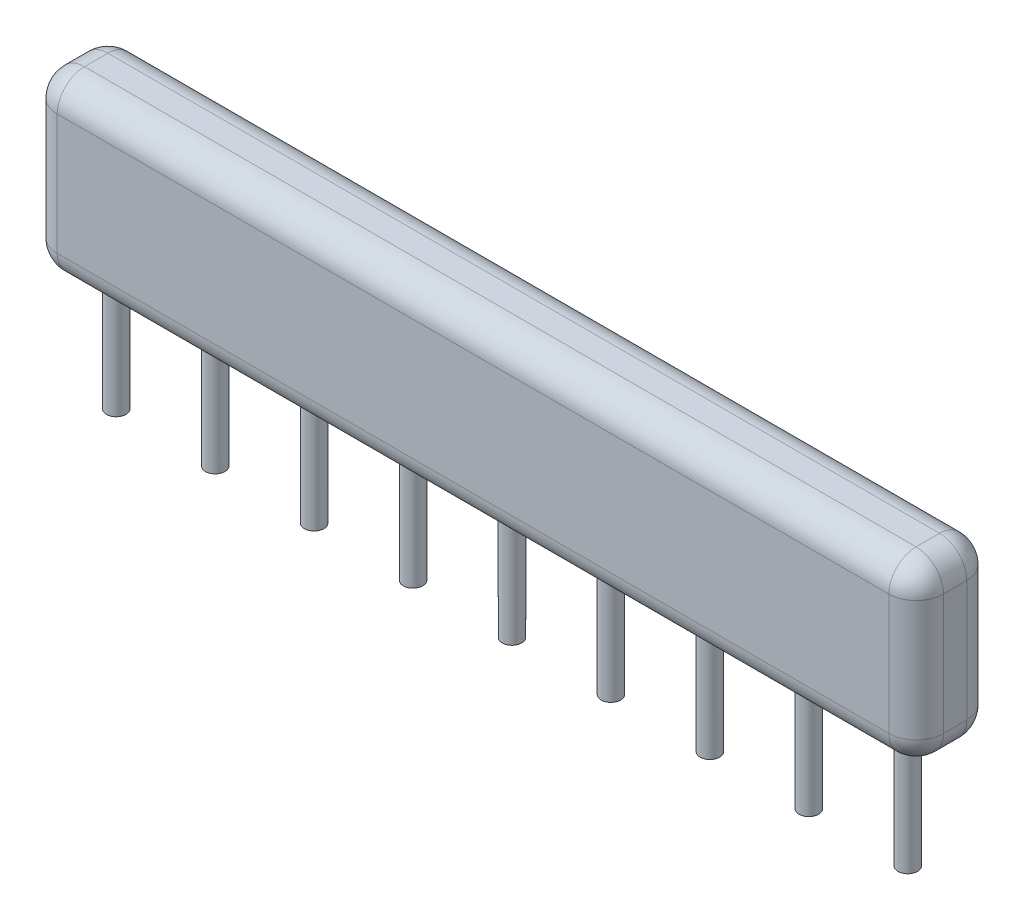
ISO-10303-21;
HEADER;
FILE_DESCRIPTION(('STEP AP214'),'2;1');
FILE_NAME('part.step','',(''),(''),'','','');
FILE_SCHEMA(('AUTOMOTIVE_DESIGN { 1 0 10303 214 1 1 1 1 }'));
ENDSEC;
DATA;
#1=APPLICATION_CONTEXT('core data for automotive mechanical design processes');
#2=APPLICATION_PROTOCOL_DEFINITION('international standard','automotive_design',2000,#1);
#3=PRODUCT_CONTEXT('',#1,'mechanical');
#4=PRODUCT('Part','Part','',(#3));
#5=PRODUCT_RELATED_PRODUCT_CATEGORY('part','',(#4));
#6=PRODUCT_DEFINITION_FORMATION('','',#4);
#7=PRODUCT_DEFINITION_CONTEXT('part definition',#1,'design');
#8=PRODUCT_DEFINITION('design','',#6,#7);
#9=PRODUCT_DEFINITION_SHAPE('','',#8);
#10=(LENGTH_UNIT() NAMED_UNIT(*) SI_UNIT(.MILLI.,.METRE.));
#11=(NAMED_UNIT(*) PLANE_ANGLE_UNIT() SI_UNIT($,.RADIAN.));
#12=(NAMED_UNIT(*) SI_UNIT($,.STERADIAN.) SOLID_ANGLE_UNIT());
#13=UNCERTAINTY_MEASURE_WITH_UNIT(LENGTH_MEASURE(1.E-05),#10,'distance_accuracy_value','');
#14=(GEOMETRIC_REPRESENTATION_CONTEXT(3) GLOBAL_UNCERTAINTY_ASSIGNED_CONTEXT((#13)) GLOBAL_UNIT_ASSIGNED_CONTEXT((#10,
#11,#12)) REPRESENTATION_CONTEXT('',''));
#15=CARTESIAN_POINT('',(0.,0.,0.));
#16=DIRECTION('',(0.,0.,1.));
#17=DIRECTION('',(1.,0.,0.));
#18=AXIS2_PLACEMENT_3D('',#15,#16,#17);
#19=CARTESIAN_POINT('',(0.,0.,2.));
#20=DIRECTION('',(0.,1.,0.));
#21=DIRECTION('',(0.,0.,1.));
#22=AXIS2_PLACEMENT_3D('',#19,#20,#21);
#23=PLANE('',#22);
#24=DIRECTION('',(0.,0.,-1.));
#25=VECTOR('',#24,1.);
#26=CARTESIAN_POINT('',(0.7,0.,2.));
#27=LINE('',#26,#25);
#28=CARTESIAN_POINT('',(0.7,0.,1.3));
#29=VERTEX_POINT('',#28);
#30=CARTESIAN_POINT('',(0.7,0.,0.7));
#31=VERTEX_POINT('',#30);
#32=EDGE_CURVE('E153',#29,#31,#27,.T.);
#33=ORIENTED_EDGE('',*,*,#32,.T.);
#34=DIRECTION('',(1.,0.,0.));
#35=VECTOR('',#34,1.);
#36=CARTESIAN_POINT('',(0.,0.,0.7));
#37=LINE('',#36,#35);
#38=CARTESIAN_POINT('',(22.05,0.,0.7));
#39=VERTEX_POINT('',#38);
#40=EDGE_CURVE('E266',#31,#39,#37,.T.);
#41=ORIENTED_EDGE('',*,*,#40,.T.);
#42=DIRECTION('',(0.,0.,-1.));
#43=VECTOR('',#42,1.);
#44=CARTESIAN_POINT('',(22.05,0.,2.));
#45=LINE('',#44,#43);
#46=CARTESIAN_POINT('',(22.05,0.,1.3));
#47=VERTEX_POINT('',#46);
#48=EDGE_CURVE('E263',#39,#47,#45,.F.);
#49=ORIENTED_EDGE('',*,*,#48,.T.);
#50=DIRECTION('',(1.,0.,0.));
#51=VECTOR('',#50,1.);
#52=CARTESIAN_POINT('',(0.,0.,1.3));
#53=LINE('',#52,#51);
#54=EDGE_CURVE('E261',#47,#29,#53,.F.);
#55=ORIENTED_EDGE('',*,*,#54,.T.);
#56=EDGE_LOOP('',(#33,#41,#49,#55));
#57=FACE_BOUND('',#56,.T.);
#58=CARTESIAN_POINT('',(18.995,0.,1.));
#59=DIRECTION('',(0.,1.,0.));
#60=DIRECTION('',(0.,0.,1.));
#61=AXIS2_PLACEMENT_3D('',#58,#59,#60);
#62=CIRCLE('',#61,0.25);
#63=CARTESIAN_POINT('',(18.995,0.,1.25));
#64=VERTEX_POINT('',#63);
#65=EDGE_CURVE('E245',#64,#64,#62,.F.);
#66=ORIENTED_EDGE('',*,*,#65,.F.);
#67=EDGE_LOOP('',(#66));
#68=FACE_BOUND('',#67,.T.);
#69=CARTESIAN_POINT('',(13.915,0.,1.));
#70=DIRECTION('',(0.,1.,0.));
#71=DIRECTION('',(0.,0.,1.));
#72=AXIS2_PLACEMENT_3D('',#69,#70,#71);
#73=CIRCLE('',#72,0.25);
#74=CARTESIAN_POINT('',(13.915,0.,1.25));
#75=VERTEX_POINT('',#74);
#76=EDGE_CURVE('E239',#75,#75,#73,.F.);
#77=ORIENTED_EDGE('',*,*,#76,.F.);
#78=EDGE_LOOP('',(#77));
#79=FACE_BOUND('',#78,.T.);
#80=CARTESIAN_POINT('',(8.835,0.,1.));
#81=DIRECTION('',(0.,1.,0.));
#82=DIRECTION('',(0.,0.,1.));
#83=AXIS2_PLACEMENT_3D('',#80,#81,#82);
#84=CIRCLE('',#83,0.25);
#85=CARTESIAN_POINT('',(8.835,0.,1.25));
#86=VERTEX_POINT('',#85);
#87=EDGE_CURVE('E233',#86,#86,#84,.F.);
#88=ORIENTED_EDGE('',*,*,#87,.F.);
#89=EDGE_LOOP('',(#88));
#90=FACE_BOUND('',#89,.T.);
#91=CARTESIAN_POINT('',(3.755,0.,1.));
#92=DIRECTION('',(0.,1.,0.));
#93=DIRECTION('',(0.,0.,1.));
#94=AXIS2_PLACEMENT_3D('',#91,#92,#93);
#95=CIRCLE('',#94,0.25);
#96=CARTESIAN_POINT('',(3.755,0.,1.25));
#97=VERTEX_POINT('',#96);
#98=EDGE_CURVE('E227',#97,#97,#95,.F.);
#99=ORIENTED_EDGE('',*,*,#98,.F.);
#100=EDGE_LOOP('',(#99));
#101=FACE_BOUND('',#100,.T.);
#102=CARTESIAN_POINT('',(1.215,0.,1.));
#103=DIRECTION('',(0.,1.,0.));
#104=DIRECTION('',(0.,0.,1.));
#105=AXIS2_PLACEMENT_3D('',#102,#103,#104);
#106=CIRCLE('',#105,0.25);
#107=CARTESIAN_POINT('',(1.215,0.,1.25));
#108=VERTEX_POINT('',#107);
#109=EDGE_CURVE('E224',#108,#108,#106,.F.);
#110=ORIENTED_EDGE('',*,*,#109,.F.);
#111=EDGE_LOOP('',(#110));
#112=FACE_BOUND('',#111,.T.);
#113=CARTESIAN_POINT('',(6.295,0.,1.));
#114=DIRECTION('',(0.,1.,0.));
#115=DIRECTION('',(0.,0.,1.));
#116=AXIS2_PLACEMENT_3D('',#113,#114,#115);
#117=CIRCLE('',#116,0.25);
#118=CARTESIAN_POINT('',(6.295,0.,1.25));
#119=VERTEX_POINT('',#118);
#120=EDGE_CURVE('E230',#119,#119,#117,.F.);
#121=ORIENTED_EDGE('',*,*,#120,.F.);
#122=EDGE_LOOP('',(#121));
#123=FACE_BOUND('',#122,.T.);
#124=CARTESIAN_POINT('',(11.375,0.,1.));
#125=DIRECTION('',(0.,1.,0.));
#126=DIRECTION('',(0.,0.,1.));
#127=AXIS2_PLACEMENT_3D('',#124,#125,#126);
#128=CIRCLE('',#127,0.25);
#129=CARTESIAN_POINT('',(11.375,0.,1.25));
#130=VERTEX_POINT('',#129);
#131=EDGE_CURVE('E236',#130,#130,#128,.F.);
#132=ORIENTED_EDGE('',*,*,#131,.F.);
#133=EDGE_LOOP('',(#132));
#134=FACE_BOUND('',#133,.T.);
#135=CARTESIAN_POINT('',(16.455,0.,1.));
#136=DIRECTION('',(0.,1.,0.));
#137=DIRECTION('',(0.,0.,1.));
#138=AXIS2_PLACEMENT_3D('',#135,#136,#137);
#139=CIRCLE('',#138,0.25);
#140=CARTESIAN_POINT('',(16.455,0.,1.25));
#141=VERTEX_POINT('',#140);
#142=EDGE_CURVE('E242',#141,#141,#139,.F.);
#143=ORIENTED_EDGE('',*,*,#142,.F.);
#144=EDGE_LOOP('',(#143));
#145=FACE_BOUND('',#144,.T.);
#146=CARTESIAN_POINT('',(21.535,0.,1.));
#147=DIRECTION('',(0.,1.,0.));
#148=DIRECTION('',(0.,0.,1.));
#149=AXIS2_PLACEMENT_3D('',#146,#147,#148);
#150=CIRCLE('',#149,0.25);
#151=CARTESIAN_POINT('',(21.535,0.,1.25));
#152=VERTEX_POINT('',#151);
#153=EDGE_CURVE('E141',#152,#152,#150,.F.);
#154=ORIENTED_EDGE('',*,*,#153,.F.);
#155=EDGE_LOOP('',(#154));
#156=FACE_BOUND('',#155,.T.);
#157=ADVANCED_FACE('F30',(#57,#68,#79,#90,#101,#112,#123,#134,#145,#156),#23,.F.);
#158=CARTESIAN_POINT('',(0.,4.5,2.));
#159=DIRECTION('',(1.,0.,0.));
#160=DIRECTION('',(0.,0.,-1.));
#161=AXIS2_PLACEMENT_3D('',#158,#159,#160);
#162=PLANE('',#161);
#163=DIRECTION('',(0.,0.,-1.));
#164=VECTOR('',#163,1.);
#165=CARTESIAN_POINT('',(0.,3.8,2.));
#166=LINE('',#165,#164);
#167=CARTESIAN_POINT('',(0.,3.8,1.3));
#168=VERTEX_POINT('',#167);
#169=CARTESIAN_POINT('',(0.,3.8,0.7));
#170=VERTEX_POINT('',#169);
#171=EDGE_CURVE('E129',#168,#170,#166,.T.);
#172=ORIENTED_EDGE('',*,*,#171,.T.);
#173=DIRECTION('',(0.,-1.,0.));
#174=VECTOR('',#173,1.);
#175=CARTESIAN_POINT('',(0.,4.5,0.7));
#176=LINE('',#175,#174);
#177=CARTESIAN_POINT('',(0.,0.7,0.7));
#178=VERTEX_POINT('',#177);
#179=EDGE_CURVE('E125',#170,#178,#176,.T.);
#180=ORIENTED_EDGE('',*,*,#179,.T.);
#181=DIRECTION('',(0.,0.,-1.));
#182=VECTOR('',#181,1.);
#183=CARTESIAN_POINT('',(0.,0.7,2.));
#184=LINE('',#183,#182);
#185=CARTESIAN_POINT('',(0.,0.7,1.3));
#186=VERTEX_POINT('',#185);
#187=EDGE_CURVE('E120',#178,#186,#184,.F.);
#188=ORIENTED_EDGE('',*,*,#187,.T.);
#189=DIRECTION('',(0.,-1.,0.));
#190=VECTOR('',#189,1.);
#191=CARTESIAN_POINT('',(0.,4.5,1.3));
#192=LINE('',#191,#190);
#193=EDGE_CURVE('E122',#186,#168,#192,.F.);
#194=ORIENTED_EDGE('',*,*,#193,.T.);
#195=EDGE_LOOP('',(#172,#180,#188,#194));
#196=FACE_BOUND('',#195,.T.);
#197=ADVANCED_FACE('F32',(#196),#162,.F.);
#198=CARTESIAN_POINT('',(22.75,4.5,2.));
#199=DIRECTION('',(-1.,0.,0.));
#200=DIRECTION('',(0.,0.,1.));
#201=AXIS2_PLACEMENT_3D('',#198,#199,#200);
#202=PLANE('',#201);
#203=DIRECTION('',(0.,0.,-1.));
#204=VECTOR('',#203,1.);
#205=CARTESIAN_POINT('',(22.75,0.7,2.));
#206=LINE('',#205,#204);
#207=CARTESIAN_POINT('',(22.75,0.7,1.3));
#208=VERTEX_POINT('',#207);
#209=CARTESIAN_POINT('',(22.75,0.7,0.7));
#210=VERTEX_POINT('',#209);
#211=EDGE_CURVE('E272',#208,#210,#206,.T.);
#212=ORIENTED_EDGE('',*,*,#211,.T.);
#213=DIRECTION('',(0.,1.,0.));
#214=VECTOR('',#213,1.);
#215=CARTESIAN_POINT('',(22.75,4.5,0.7));
#216=LINE('',#215,#214);
#217=CARTESIAN_POINT('',(22.75,3.8,0.7));
#218=VERTEX_POINT('',#217);
#219=EDGE_CURVE('E275',#210,#218,#216,.T.);
#220=ORIENTED_EDGE('',*,*,#219,.T.);
#221=DIRECTION('',(0.,0.,-1.));
#222=VECTOR('',#221,1.);
#223=CARTESIAN_POINT('',(22.75,3.8,2.));
#224=LINE('',#223,#222);
#225=CARTESIAN_POINT('',(22.75,3.8,1.3));
#226=VERTEX_POINT('',#225);
#227=EDGE_CURVE('E270',#218,#226,#224,.F.);
#228=ORIENTED_EDGE('',*,*,#227,.T.);
#229=DIRECTION('',(0.,1.,0.));
#230=VECTOR('',#229,1.);
#231=CARTESIAN_POINT('',(22.75,0.,1.3));
#232=LINE('',#231,#230);
#233=EDGE_CURVE('E268',#226,#208,#232,.F.);
#234=ORIENTED_EDGE('',*,*,#233,.T.);
#235=EDGE_LOOP('',(#212,#220,#228,#234));
#236=FACE_BOUND('',#235,.T.);
#237=ADVANCED_FACE('F362',(#236),#202,.F.);
#238=CARTESIAN_POINT('',(0.,4.5,2.));
#239=DIRECTION('',(0.,-1.,0.));
#240=DIRECTION('',(0.,0.,-1.));
#241=AXIS2_PLACEMENT_3D('',#238,#239,#240);
#242=PLANE('',#241);
#243=DIRECTION('',(0.,0.,-1.));
#244=VECTOR('',#243,1.);
#245=CARTESIAN_POINT('',(22.05,4.5,2.));
#246=LINE('',#245,#244);
#247=CARTESIAN_POINT('',(22.05,4.5,1.3));
#248=VERTEX_POINT('',#247);
#249=CARTESIAN_POINT('',(22.05,4.5,0.7));
#250=VERTEX_POINT('',#249);
#251=EDGE_CURVE('E279',#248,#250,#246,.T.);
#252=ORIENTED_EDGE('',*,*,#251,.T.);
#253=DIRECTION('',(-1.,0.,0.));
#254=VECTOR('',#253,1.);
#255=CARTESIAN_POINT('',(0.,4.5,0.7));
#256=LINE('',#255,#254);
#257=CARTESIAN_POINT('',(0.7,4.5,0.7));
#258=VERTEX_POINT('',#257);
#259=EDGE_CURVE('E284',#250,#258,#256,.T.);
#260=ORIENTED_EDGE('',*,*,#259,.T.);
#261=DIRECTION('',(0.,0.,-1.));
#262=VECTOR('',#261,1.);
#263=CARTESIAN_POINT('',(0.7,4.5,2.));
#264=LINE('',#263,#262);
#265=CARTESIAN_POINT('',(0.7,4.5,1.3));
#266=VERTEX_POINT('',#265);
#267=EDGE_CURVE('E281',#258,#266,#264,.F.);
#268=ORIENTED_EDGE('',*,*,#267,.T.);
#269=DIRECTION('',(-1.,0.,0.));
#270=VECTOR('',#269,1.);
#271=CARTESIAN_POINT('',(22.75,4.5,1.3));
#272=LINE('',#271,#270);
#273=EDGE_CURVE('E277',#266,#248,#272,.F.);
#274=ORIENTED_EDGE('',*,*,#273,.T.);
#275=EDGE_LOOP('',(#252,#260,#268,#274));
#276=FACE_BOUND('',#275,.T.);
#277=ADVANCED_FACE('F368',(#276),#242,.F.);
#278=CARTESIAN_POINT('',(0.,0.,2.));
#279=DIRECTION('',(0.,0.,1.));
#280=DIRECTION('',(1.,0.,0.));
#281=AXIS2_PLACEMENT_3D('',#278,#279,#280);
#282=PLANE('',#281);
#283=DIRECTION('',(1.,0.,0.));
#284=VECTOR('',#283,1.);
#285=CARTESIAN_POINT('',(22.75,0.7,2.));
#286=LINE('',#285,#284);
#287=CARTESIAN_POINT('',(0.7,0.7,2.));
#288=VERTEX_POINT('',#287);
#289=CARTESIAN_POINT('',(22.05,0.7,2.));
#290=VERTEX_POINT('',#289);
#291=EDGE_CURVE('E38',#288,#290,#286,.T.);
#292=ORIENTED_EDGE('',*,*,#291,.T.);
#293=DIRECTION('',(0.,1.,0.));
#294=VECTOR('',#293,1.);
#295=CARTESIAN_POINT('',(22.05,4.5,2.));
#296=LINE('',#295,#294);
#297=CARTESIAN_POINT('',(22.05,3.8,2.));
#298=VERTEX_POINT('',#297);
#299=EDGE_CURVE('E11',#290,#298,#296,.T.);
#300=ORIENTED_EDGE('',*,*,#299,.T.);
#301=DIRECTION('',(-1.,0.,0.));
#302=VECTOR('',#301,1.);
#303=CARTESIAN_POINT('',(0.,3.8,2.));
#304=LINE('',#303,#302);
#305=CARTESIAN_POINT('',(0.7,3.8,2.));
#306=VERTEX_POINT('',#305);
#307=EDGE_CURVE('E288',#298,#306,#304,.T.);
#308=ORIENTED_EDGE('',*,*,#307,.T.);
#309=DIRECTION('',(0.,-1.,0.));
#310=VECTOR('',#309,1.);
#311=CARTESIAN_POINT('',(0.7,0.,2.));
#312=LINE('',#311,#310);
#313=EDGE_CURVE('E286',#306,#288,#312,.T.);
#314=ORIENTED_EDGE('',*,*,#313,.T.);
#315=EDGE_LOOP('',(#292,#300,#308,#314));
#316=FACE_BOUND('',#315,.T.);
#317=ADVANCED_FACE('F289',(#316),#282,.T.);
#318=CARTESIAN_POINT('',(0.,0.,0.));
#319=DIRECTION('',(0.,0.,1.));
#320=DIRECTION('',(1.,0.,0.));
#321=AXIS2_PLACEMENT_3D('',#318,#319,#320);
#322=PLANE('',#321);
#323=DIRECTION('',(1.,0.,0.));
#324=VECTOR('',#323,1.);
#325=CARTESIAN_POINT('',(0.,0.7,0.));
#326=LINE('',#325,#324);
#327=CARTESIAN_POINT('',(22.05,0.7,0.));
#328=VERTEX_POINT('',#327);
#329=CARTESIAN_POINT('',(0.7,0.7,0.));
#330=VERTEX_POINT('',#329);
#331=EDGE_CURVE('E256',#328,#330,#326,.F.);
#332=ORIENTED_EDGE('',*,*,#331,.T.);
#333=DIRECTION('',(0.,-1.,0.));
#334=VECTOR('',#333,1.);
#335=CARTESIAN_POINT('',(0.7,0.,0.));
#336=LINE('',#335,#334);
#337=CARTESIAN_POINT('',(0.7,3.8,0.));
#338=VERTEX_POINT('',#337);
#339=EDGE_CURVE('E258',#330,#338,#336,.F.);
#340=ORIENTED_EDGE('',*,*,#339,.T.);
#341=DIRECTION('',(-1.,0.,0.));
#342=VECTOR('',#341,1.);
#343=CARTESIAN_POINT('',(0.,3.8,0.));
#344=LINE('',#343,#342);
#345=CARTESIAN_POINT('',(22.05,3.8,0.));
#346=VERTEX_POINT('',#345);
#347=EDGE_CURVE('E254',#338,#346,#344,.F.);
#348=ORIENTED_EDGE('',*,*,#347,.T.);
#349=DIRECTION('',(0.,1.,0.));
#350=VECTOR('',#349,1.);
#351=CARTESIAN_POINT('',(22.05,0.,0.));
#352=LINE('',#351,#350);
#353=EDGE_CURVE('E252',#346,#328,#352,.F.);
#354=ORIENTED_EDGE('',*,*,#353,.T.);
#355=EDGE_LOOP('',(#332,#340,#348,#354));
#356=FACE_BOUND('',#355,.T.);
#357=ADVANCED_FACE('F373',(#356),#322,.F.);
#358=CARTESIAN_POINT('',(1.215,-3.,1.));
#359=DIRECTION('',(0.,1.,0.));
#360=DIRECTION('',(0.,0.,1.));
#361=AXIS2_PLACEMENT_3D('',#358,#359,#360);
#362=CYLINDRICAL_SURFACE('',#361,0.25);
#363=CARTESIAN_POINT('',(1.215,-3.,1.));
#364=DIRECTION('',(0.,-1.,0.));
#365=DIRECTION('',(0.,0.,-1.));
#366=AXIS2_PLACEMENT_3D('',#363,#364,#365);
#367=CIRCLE('',#366,0.25);
#368=CARTESIAN_POINT('',(1.215,-3.,0.75));
#369=VERTEX_POINT('',#368);
#370=EDGE_CURVE('E221',#369,#369,#367,.T.);
#371=ORIENTED_EDGE('',*,*,#370,.F.);
#372=EDGE_LOOP('',(#371));
#373=FACE_BOUND('',#372,.T.);
#374=ORIENTED_EDGE('',*,*,#109,.T.);
#375=EDGE_LOOP('',(#374));
#376=FACE_BOUND('',#375,.T.);
#377=ADVANCED_FACE('F397',(#373,#376),#362,.T.);
#378=CARTESIAN_POINT('',(1.215,-3.,1.));
#379=DIRECTION('',(0.,-1.,0.));
#380=DIRECTION('',(0.,0.,-1.));
#381=AXIS2_PLACEMENT_3D('',#378,#379,#380);
#382=PLANE('',#381);
#383=ORIENTED_EDGE('',*,*,#370,.T.);
#384=EDGE_LOOP('',(#383));
#385=FACE_BOUND('',#384,.T.);
#386=ADVANCED_FACE('F400',(#385),#382,.T.);
#387=CARTESIAN_POINT('',(3.755,-3.,1.));
#388=DIRECTION('',(0.,1.,0.));
#389=DIRECTION('',(0.,0.,1.));
#390=AXIS2_PLACEMENT_3D('',#387,#388,#389);
#391=CYLINDRICAL_SURFACE('',#390,0.25);
#392=CARTESIAN_POINT('',(3.755,-3.,1.));
#393=DIRECTION('',(0.,-1.,0.));
#394=DIRECTION('',(0.,0.,-1.));
#395=AXIS2_PLACEMENT_3D('',#392,#393,#394);
#396=CIRCLE('',#395,0.25);
#397=CARTESIAN_POINT('',(3.755,-3.,0.75));
#398=VERTEX_POINT('',#397);
#399=EDGE_CURVE('E218',#398,#398,#396,.T.);
#400=ORIENTED_EDGE('',*,*,#399,.F.);
#401=EDGE_LOOP('',(#400));
#402=FACE_BOUND('',#401,.T.);
#403=ORIENTED_EDGE('',*,*,#98,.T.);
#404=EDGE_LOOP('',(#403));
#405=FACE_BOUND('',#404,.T.);
#406=ADVANCED_FACE('F404',(#402,#405),#391,.T.);
#407=CARTESIAN_POINT('',(3.755,-3.,1.));
#408=DIRECTION('',(0.,-1.,0.));
#409=DIRECTION('',(0.,0.,-1.));
#410=AXIS2_PLACEMENT_3D('',#407,#408,#409);
#411=PLANE('',#410);
#412=ORIENTED_EDGE('',*,*,#399,.T.);
#413=EDGE_LOOP('',(#412));
#414=FACE_BOUND('',#413,.T.);
#415=ADVANCED_FACE('F408',(#414),#411,.T.);
#416=CARTESIAN_POINT('',(6.295,-3.,1.));
#417=DIRECTION('',(0.,1.,0.));
#418=DIRECTION('',(0.,0.,1.));
#419=AXIS2_PLACEMENT_3D('',#416,#417,#418);
#420=CYLINDRICAL_SURFACE('',#419,0.25);
#421=CARTESIAN_POINT('',(6.295,-3.,1.));
#422=DIRECTION('',(0.,-1.,0.));
#423=DIRECTION('',(0.,0.,-1.));
#424=AXIS2_PLACEMENT_3D('',#421,#422,#423);
#425=CIRCLE('',#424,0.25);
#426=CARTESIAN_POINT('',(6.295,-3.,0.75));
#427=VERTEX_POINT('',#426);
#428=EDGE_CURVE('E215',#427,#427,#425,.T.);
#429=ORIENTED_EDGE('',*,*,#428,.F.);
#430=EDGE_LOOP('',(#429));
#431=FACE_BOUND('',#430,.T.);
#432=ORIENTED_EDGE('',*,*,#120,.T.);
#433=EDGE_LOOP('',(#432));
#434=FACE_BOUND('',#433,.T.);
#435=ADVANCED_FACE('F412',(#431,#434),#420,.T.);
#436=CARTESIAN_POINT('',(6.295,-3.,1.));
#437=DIRECTION('',(0.,-1.,0.));
#438=DIRECTION('',(0.,0.,-1.));
#439=AXIS2_PLACEMENT_3D('',#436,#437,#438);
#440=PLANE('',#439);
#441=ORIENTED_EDGE('',*,*,#428,.T.);
#442=EDGE_LOOP('',(#441));
#443=FACE_BOUND('',#442,.T.);
#444=ADVANCED_FACE('F416',(#443),#440,.T.);
#445=CARTESIAN_POINT('',(8.835,-3.,1.));
#446=DIRECTION('',(0.,1.,0.));
#447=DIRECTION('',(0.,0.,1.));
#448=AXIS2_PLACEMENT_3D('',#445,#446,#447);
#449=CYLINDRICAL_SURFACE('',#448,0.25);
#450=CARTESIAN_POINT('',(8.835,-3.,1.));
#451=DIRECTION('',(0.,-1.,0.));
#452=DIRECTION('',(0.,0.,-1.));
#453=AXIS2_PLACEMENT_3D('',#450,#451,#452);
#454=CIRCLE('',#453,0.25);
#455=CARTESIAN_POINT('',(8.835,-3.,0.75));
#456=VERTEX_POINT('',#455);
#457=EDGE_CURVE('E212',#456,#456,#454,.T.);
#458=ORIENTED_EDGE('',*,*,#457,.F.);
#459=EDGE_LOOP('',(#458));
#460=FACE_BOUND('',#459,.T.);
#461=ORIENTED_EDGE('',*,*,#87,.T.);
#462=EDGE_LOOP('',(#461));
#463=FACE_BOUND('',#462,.T.);
#464=ADVANCED_FACE('F420',(#460,#463),#449,.T.);
#465=CARTESIAN_POINT('',(8.835,-3.,1.));
#466=DIRECTION('',(0.,-1.,0.));
#467=DIRECTION('',(0.,0.,-1.));
#468=AXIS2_PLACEMENT_3D('',#465,#466,#467);
#469=PLANE('',#468);
#470=ORIENTED_EDGE('',*,*,#457,.T.);
#471=EDGE_LOOP('',(#470));
#472=FACE_BOUND('',#471,.T.);
#473=ADVANCED_FACE('F424',(#472),#469,.T.);
#474=CARTESIAN_POINT('',(11.375,-3.,1.));
#475=DIRECTION('',(0.,1.,0.));
#476=DIRECTION('',(0.,0.,1.));
#477=AXIS2_PLACEMENT_3D('',#474,#475,#476);
#478=CYLINDRICAL_SURFACE('',#477,0.25);
#479=CARTESIAN_POINT('',(11.375,-3.,1.));
#480=DIRECTION('',(0.,-1.,0.));
#481=DIRECTION('',(0.,0.,-1.));
#482=AXIS2_PLACEMENT_3D('',#479,#480,#481);
#483=CIRCLE('',#482,0.25);
#484=CARTESIAN_POINT('',(11.375,-3.,0.75));
#485=VERTEX_POINT('',#484);
#486=EDGE_CURVE('E209',#485,#485,#483,.T.);
#487=ORIENTED_EDGE('',*,*,#486,.F.);
#488=EDGE_LOOP('',(#487));
#489=FACE_BOUND('',#488,.T.);
#490=ORIENTED_EDGE('',*,*,#131,.T.);
#491=EDGE_LOOP('',(#490));
#492=FACE_BOUND('',#491,.T.);
#493=ADVANCED_FACE('F428',(#489,#492),#478,.T.);
#494=CARTESIAN_POINT('',(11.375,-3.,1.));
#495=DIRECTION('',(0.,-1.,0.));
#496=DIRECTION('',(0.,0.,-1.));
#497=AXIS2_PLACEMENT_3D('',#494,#495,#496);
#498=PLANE('',#497);
#499=ORIENTED_EDGE('',*,*,#486,.T.);
#500=EDGE_LOOP('',(#499));
#501=FACE_BOUND('',#500,.T.);
#502=ADVANCED_FACE('F432',(#501),#498,.T.);
#503=CARTESIAN_POINT('',(13.915,-3.,1.));
#504=DIRECTION('',(0.,1.,0.));
#505=DIRECTION('',(0.,0.,1.));
#506=AXIS2_PLACEMENT_3D('',#503,#504,#505);
#507=CYLINDRICAL_SURFACE('',#506,0.25);
#508=CARTESIAN_POINT('',(13.915,-3.,1.));
#509=DIRECTION('',(0.,-1.,0.));
#510=DIRECTION('',(0.,0.,-1.));
#511=AXIS2_PLACEMENT_3D('',#508,#509,#510);
#512=CIRCLE('',#511,0.25);
#513=CARTESIAN_POINT('',(13.915,-3.,0.75));
#514=VERTEX_POINT('',#513);
#515=EDGE_CURVE('E206',#514,#514,#512,.T.);
#516=ORIENTED_EDGE('',*,*,#515,.F.);
#517=EDGE_LOOP('',(#516));
#518=FACE_BOUND('',#517,.T.);
#519=ORIENTED_EDGE('',*,*,#76,.T.);
#520=EDGE_LOOP('',(#519));
#521=FACE_BOUND('',#520,.T.);
#522=ADVANCED_FACE('F436',(#518,#521),#507,.T.);
#523=CARTESIAN_POINT('',(13.915,-3.,1.));
#524=DIRECTION('',(0.,-1.,0.));
#525=DIRECTION('',(0.,0.,-1.));
#526=AXIS2_PLACEMENT_3D('',#523,#524,#525);
#527=PLANE('',#526);
#528=ORIENTED_EDGE('',*,*,#515,.T.);
#529=EDGE_LOOP('',(#528));
#530=FACE_BOUND('',#529,.T.);
#531=ADVANCED_FACE('F440',(#530),#527,.T.);
#532=CARTESIAN_POINT('',(16.455,-3.,1.));
#533=DIRECTION('',(0.,1.,0.));
#534=DIRECTION('',(0.,0.,1.));
#535=AXIS2_PLACEMENT_3D('',#532,#533,#534);
#536=CYLINDRICAL_SURFACE('',#535,0.25);
#537=CARTESIAN_POINT('',(16.455,-3.,1.));
#538=DIRECTION('',(0.,-1.,0.));
#539=DIRECTION('',(0.,0.,-1.));
#540=AXIS2_PLACEMENT_3D('',#537,#538,#539);
#541=CIRCLE('',#540,0.25);
#542=CARTESIAN_POINT('',(16.455,-3.,0.75));
#543=VERTEX_POINT('',#542);
#544=EDGE_CURVE('E203',#543,#543,#541,.T.);
#545=ORIENTED_EDGE('',*,*,#544,.F.);
#546=EDGE_LOOP('',(#545));
#547=FACE_BOUND('',#546,.T.);
#548=ORIENTED_EDGE('',*,*,#142,.T.);
#549=EDGE_LOOP('',(#548));
#550=FACE_BOUND('',#549,.T.);
#551=ADVANCED_FACE('F444',(#547,#550),#536,.T.);
#552=CARTESIAN_POINT('',(16.455,-3.,1.));
#553=DIRECTION('',(0.,-1.,0.));
#554=DIRECTION('',(0.,0.,-1.));
#555=AXIS2_PLACEMENT_3D('',#552,#553,#554);
#556=PLANE('',#555);
#557=ORIENTED_EDGE('',*,*,#544,.T.);
#558=EDGE_LOOP('',(#557));
#559=FACE_BOUND('',#558,.T.);
#560=ADVANCED_FACE('F448',(#559),#556,.T.);
#561=CARTESIAN_POINT('',(18.995,-3.,1.));
#562=DIRECTION('',(0.,1.,0.));
#563=DIRECTION('',(0.,0.,1.));
#564=AXIS2_PLACEMENT_3D('',#561,#562,#563);
#565=CYLINDRICAL_SURFACE('',#564,0.25);
#566=CARTESIAN_POINT('',(18.995,-3.,1.));
#567=DIRECTION('',(0.,-1.,0.));
#568=DIRECTION('',(0.,0.,-1.));
#569=AXIS2_PLACEMENT_3D('',#566,#567,#568);
#570=CIRCLE('',#569,0.25);
#571=CARTESIAN_POINT('',(18.995,-3.,0.75));
#572=VERTEX_POINT('',#571);
#573=EDGE_CURVE('E200',#572,#572,#570,.T.);
#574=ORIENTED_EDGE('',*,*,#573,.F.);
#575=EDGE_LOOP('',(#574));
#576=FACE_BOUND('',#575,.T.);
#577=ORIENTED_EDGE('',*,*,#65,.T.);
#578=EDGE_LOOP('',(#577));
#579=FACE_BOUND('',#578,.T.);
#580=ADVANCED_FACE('F452',(#576,#579),#565,.T.);
#581=CARTESIAN_POINT('',(18.995,-3.,1.));
#582=DIRECTION('',(0.,-1.,0.));
#583=DIRECTION('',(0.,0.,-1.));
#584=AXIS2_PLACEMENT_3D('',#581,#582,#583);
#585=PLANE('',#584);
#586=ORIENTED_EDGE('',*,*,#573,.T.);
#587=EDGE_LOOP('',(#586));
#588=FACE_BOUND('',#587,.T.);
#589=ADVANCED_FACE('F456',(#588),#585,.T.);
#590=CARTESIAN_POINT('',(21.535,-3.,1.));
#591=DIRECTION('',(0.,1.,0.));
#592=DIRECTION('',(0.,0.,1.));
#593=AXIS2_PLACEMENT_3D('',#590,#591,#592);
#594=CYLINDRICAL_SURFACE('',#593,0.25);
#595=CARTESIAN_POINT('',(21.535,-3.,1.));
#596=DIRECTION('',(0.,-1.,0.));
#597=DIRECTION('',(0.,0.,-1.));
#598=AXIS2_PLACEMENT_3D('',#595,#596,#597);
#599=CIRCLE('',#598,0.25);
#600=CARTESIAN_POINT('',(21.535,-3.,0.75));
#601=VERTEX_POINT('',#600);
#602=EDGE_CURVE('E197',#601,#601,#599,.T.);
#603=ORIENTED_EDGE('',*,*,#602,.F.);
#604=EDGE_LOOP('',(#603));
#605=FACE_BOUND('',#604,.T.);
#606=ORIENTED_EDGE('',*,*,#153,.T.);
#607=EDGE_LOOP('',(#606));
#608=FACE_BOUND('',#607,.T.);
#609=ADVANCED_FACE('F460',(#605,#608),#594,.T.);
#610=CARTESIAN_POINT('',(21.535,-3.,1.));
#611=DIRECTION('',(0.,-1.,0.));
#612=DIRECTION('',(0.,0.,-1.));
#613=AXIS2_PLACEMENT_3D('',#610,#611,#612);
#614=PLANE('',#613);
#615=ORIENTED_EDGE('',*,*,#602,.T.);
#616=EDGE_LOOP('',(#615));
#617=FACE_BOUND('',#616,.T.);
#618=ADVANCED_FACE('F464',(#617),#614,.T.);
#619=CARTESIAN_POINT('',(22.05,0.,1.3));
#620=DIRECTION('',(0.,-1.,0.));
#621=DIRECTION('',(0.,0.,-1.));
#622=AXIS2_PLACEMENT_3D('',#619,#620,#621);
#623=CYLINDRICAL_SURFACE('',#622,0.7);
#624=CARTESIAN_POINT('',(22.05,3.8,1.3));
#625=DIRECTION('',(0.,1.,0.));
#626=DIRECTION('',(0.,0.,1.));
#627=AXIS2_PLACEMENT_3D('',#624,#625,#626);
#628=CIRCLE('',#627,0.7);
#629=EDGE_CURVE('E194',#298,#226,#628,.T.);
#630=ORIENTED_EDGE('',*,*,#629,.F.);
#631=ORIENTED_EDGE('',*,*,#299,.F.);
#632=CARTESIAN_POINT('',(22.05,0.7,1.3));
#633=DIRECTION('',(0.,-1.,0.));
#634=DIRECTION('',(0.,0.,-1.));
#635=AXIS2_PLACEMENT_3D('',#632,#633,#634);
#636=CIRCLE('',#635,0.7);
#637=EDGE_CURVE('E192',#208,#290,#636,.T.);
#638=ORIENTED_EDGE('',*,*,#637,.F.);
#639=ORIENTED_EDGE('',*,*,#233,.F.);
#640=EDGE_LOOP('',(#630,#631,#638,#639));
#641=FACE_BOUND('',#640,.T.);
#642=ADVANCED_FACE('F305',(#641),#623,.T.);
#643=CARTESIAN_POINT('',(22.05,3.8,1.3));
#644=DIRECTION('',(0.,0.,1.));
#645=DIRECTION('',(1.,0.,0.));
#646=AXIS2_PLACEMENT_3D('',#643,#644,#645);
#647=SPHERICAL_SURFACE('',#646,0.7);
#648=CARTESIAN_POINT('',(22.05,3.8,1.3));
#649=DIRECTION('',(1.,0.,0.));
#650=DIRECTION('',(0.,0.,-1.));
#651=AXIS2_PLACEMENT_3D('',#648,#649,#650);
#652=CIRCLE('',#651,0.7);
#653=EDGE_CURVE('E186',#298,#248,#652,.F.);
#654=ORIENTED_EDGE('',*,*,#653,.F.);
#655=ORIENTED_EDGE('',*,*,#629,.T.);
#656=CARTESIAN_POINT('',(22.05,3.8,1.3));
#657=DIRECTION('',(0.,0.,1.));
#658=DIRECTION('',(1.,0.,0.));
#659=AXIS2_PLACEMENT_3D('',#656,#657,#658);
#660=CIRCLE('',#659,0.7);
#661=EDGE_CURVE('E189',#248,#226,#660,.F.);
#662=ORIENTED_EDGE('',*,*,#661,.F.);
#663=EDGE_LOOP('',(#654,#655,#662));
#664=FACE_BOUND('',#663,.T.);
#665=ADVANCED_FACE('F310',(#664),#647,.T.);
#666=CARTESIAN_POINT('',(22.05,0.7,1.3));
#667=DIRECTION('',(0.,0.,1.));
#668=DIRECTION('',(1.,0.,0.));
#669=AXIS2_PLACEMENT_3D('',#666,#667,#668);
#670=SPHERICAL_SURFACE('',#669,0.7);
#671=CARTESIAN_POINT('',(22.05,0.7,1.3));
#672=DIRECTION('',(0.,0.,1.));
#673=DIRECTION('',(1.,0.,0.));
#674=AXIS2_PLACEMENT_3D('',#671,#672,#673);
#675=CIRCLE('',#674,0.7);
#676=EDGE_CURVE('E182',#208,#47,#675,.F.);
#677=ORIENTED_EDGE('',*,*,#676,.F.);
#678=ORIENTED_EDGE('',*,*,#637,.T.);
#679=CARTESIAN_POINT('',(22.05,0.7,1.3));
#680=DIRECTION('',(1.,0.,0.));
#681=DIRECTION('',(0.,0.,-1.));
#682=AXIS2_PLACEMENT_3D('',#679,#680,#681);
#683=CIRCLE('',#682,0.7);
#684=EDGE_CURVE('E45',#47,#290,#683,.F.);
#685=ORIENTED_EDGE('',*,*,#684,.F.);
#686=EDGE_LOOP('',(#677,#678,#685));
#687=FACE_BOUND('',#686,.T.);
#688=ADVANCED_FACE('F301',(#687),#670,.T.);
#689=CARTESIAN_POINT('',(22.05,3.8,2.));
#690=DIRECTION('',(0.,0.,-1.));
#691=DIRECTION('',(-1.,0.,0.));
#692=AXIS2_PLACEMENT_3D('',#689,#690,#691);
#693=CYLINDRICAL_SURFACE('',#692,0.7);
#694=ORIENTED_EDGE('',*,*,#661,.T.);
#695=ORIENTED_EDGE('',*,*,#227,.F.);
#696=CARTESIAN_POINT('',(22.05,3.8,0.7));
#697=DIRECTION('',(0.,0.,-1.));
#698=DIRECTION('',(-1.,0.,0.));
#699=AXIS2_PLACEMENT_3D('',#696,#697,#698);
#700=CIRCLE('',#699,0.7);
#701=EDGE_CURVE('E176',#250,#218,#700,.T.);
#702=ORIENTED_EDGE('',*,*,#701,.F.);
#703=ORIENTED_EDGE('',*,*,#251,.F.);
#704=EDGE_LOOP('',(#694,#695,#702,#703));
#705=FACE_BOUND('',#704,.T.);
#706=ADVANCED_FACE('F365',(#705),#693,.T.);
#707=CARTESIAN_POINT('',(0.,3.8,1.3));
#708=DIRECTION('',(1.,0.,0.));
#709=DIRECTION('',(0.,0.,-1.));
#710=AXIS2_PLACEMENT_3D('',#707,#708,#709);
#711=CYLINDRICAL_SURFACE('',#710,0.7);
#712=ORIENTED_EDGE('',*,*,#653,.T.);
#713=ORIENTED_EDGE('',*,*,#273,.F.);
#714=CARTESIAN_POINT('',(0.7,3.8,1.3));
#715=DIRECTION('',(-1.,0.,0.));
#716=DIRECTION('',(0.,0.,1.));
#717=AXIS2_PLACEMENT_3D('',#714,#715,#716);
#718=CIRCLE('',#717,0.7);
#719=EDGE_CURVE('E173',#306,#266,#718,.T.);
#720=ORIENTED_EDGE('',*,*,#719,.F.);
#721=ORIENTED_EDGE('',*,*,#307,.F.);
#722=EDGE_LOOP('',(#712,#713,#720,#721));
#723=FACE_BOUND('',#722,.T.);
#724=ADVANCED_FACE('F315',(#723),#711,.T.);
#725=CARTESIAN_POINT('',(0.7,0.,1.3));
#726=DIRECTION('',(0.,1.,0.));
#727=DIRECTION('',(0.,0.,1.));
#728=AXIS2_PLACEMENT_3D('',#725,#726,#727);
#729=CYLINDRICAL_SURFACE('',#728,0.7);
#730=CARTESIAN_POINT('',(0.7,0.7,1.3));
#731=DIRECTION('',(0.,-1.,0.));
#732=DIRECTION('',(0.,0.,-1.));
#733=AXIS2_PLACEMENT_3D('',#730,#731,#732);
#734=CIRCLE('',#733,0.7);
#735=EDGE_CURVE('E136',#288,#186,#734,.T.);
#736=ORIENTED_EDGE('',*,*,#735,.F.);
#737=ORIENTED_EDGE('',*,*,#313,.F.);
#738=CARTESIAN_POINT('',(0.7,3.8,1.3));
#739=DIRECTION('',(0.,1.,0.));
#740=DIRECTION('',(0.,0.,1.));
#741=AXIS2_PLACEMENT_3D('',#738,#739,#740);
#742=CIRCLE('',#741,0.7);
#743=EDGE_CURVE('E139',#168,#306,#742,.T.);
#744=ORIENTED_EDGE('',*,*,#743,.F.);
#745=ORIENTED_EDGE('',*,*,#193,.F.);
#746=EDGE_LOOP('',(#736,#737,#744,#745));
#747=FACE_BOUND('',#746,.T.);
#748=ADVANCED_FACE('F134',(#747),#729,.T.);
#749=CARTESIAN_POINT('',(0.,0.7,1.3));
#750=DIRECTION('',(-1.,0.,0.));
#751=DIRECTION('',(0.,0.,1.));
#752=AXIS2_PLACEMENT_3D('',#749,#750,#751);
#753=CYLINDRICAL_SURFACE('',#752,0.7);
#754=ORIENTED_EDGE('',*,*,#684,.T.);
#755=ORIENTED_EDGE('',*,*,#291,.F.);
#756=CARTESIAN_POINT('',(0.7,0.7,1.3));
#757=DIRECTION('',(-1.,0.,0.));
#758=DIRECTION('',(0.,0.,1.));
#759=AXIS2_PLACEMENT_3D('',#756,#757,#758);
#760=CIRCLE('',#759,0.7);
#761=EDGE_CURVE('E149',#29,#288,#760,.T.);
#762=ORIENTED_EDGE('',*,*,#761,.F.);
#763=ORIENTED_EDGE('',*,*,#54,.F.);
#764=EDGE_LOOP('',(#754,#755,#762,#763));
#765=FACE_BOUND('',#764,.T.);
#766=ADVANCED_FACE('F290',(#765),#753,.T.);
#767=CARTESIAN_POINT('',(22.05,0.7,2.));
#768=DIRECTION('',(0.,0.,-1.));
#769=DIRECTION('',(-1.,0.,0.));
#770=AXIS2_PLACEMENT_3D('',#767,#768,#769);
#771=CYLINDRICAL_SURFACE('',#770,0.7);
#772=ORIENTED_EDGE('',*,*,#676,.T.);
#773=ORIENTED_EDGE('',*,*,#48,.F.);
#774=CARTESIAN_POINT('',(22.05,0.7,0.7));
#775=DIRECTION('',(0.,0.,-1.));
#776=DIRECTION('',(-1.,0.,0.));
#777=AXIS2_PLACEMENT_3D('',#774,#775,#776);
#778=CIRCLE('',#777,0.7);
#779=EDGE_CURVE('E168',#210,#39,#778,.T.);
#780=ORIENTED_EDGE('',*,*,#779,.F.);
#781=ORIENTED_EDGE('',*,*,#211,.F.);
#782=EDGE_LOOP('',(#772,#773,#780,#781));
#783=FACE_BOUND('',#782,.T.);
#784=ADVANCED_FACE('F299',(#783),#771,.T.);
#785=CARTESIAN_POINT('',(22.05,4.5,0.7));
#786=DIRECTION('',(0.,1.,0.));
#787=DIRECTION('',(0.,0.,1.));
#788=AXIS2_PLACEMENT_3D('',#785,#786,#787);
#789=CYLINDRICAL_SURFACE('',#788,0.7);
#790=CARTESIAN_POINT('',(22.05,3.8,0.7));
#791=DIRECTION('',(0.,1.,0.));
#792=DIRECTION('',(0.,0.,1.));
#793=AXIS2_PLACEMENT_3D('',#790,#791,#792);
#794=CIRCLE('',#793,0.7);
#795=EDGE_CURVE('E179',#218,#346,#794,.T.);
#796=ORIENTED_EDGE('',*,*,#795,.F.);
#797=ORIENTED_EDGE('',*,*,#219,.F.);
#798=CARTESIAN_POINT('',(22.05,0.7,0.7));
#799=DIRECTION('',(0.,-1.,0.));
#800=DIRECTION('',(1.,0.,0.));
#801=AXIS2_PLACEMENT_3D('',#798,#799,#800);
#802=CIRCLE('',#801,0.7);
#803=EDGE_CURVE('E166',#328,#210,#802,.T.);
#804=ORIENTED_EDGE('',*,*,#803,.F.);
#805=ORIENTED_EDGE('',*,*,#353,.F.);
#806=EDGE_LOOP('',(#796,#797,#804,#805));
#807=FACE_BOUND('',#806,.T.);
#808=ADVANCED_FACE('F358',(#807),#789,.T.);
#809=CARTESIAN_POINT('',(22.05,3.8,0.7));
#810=DIRECTION('',(0.,0.,1.));
#811=DIRECTION('',(1.,0.,0.));
#812=AXIS2_PLACEMENT_3D('',#809,#810,#811);
#813=SPHERICAL_SURFACE('',#812,0.7);
#814=ORIENTED_EDGE('',*,*,#701,.T.);
#815=ORIENTED_EDGE('',*,*,#795,.T.);
#816=CARTESIAN_POINT('',(22.05,3.8,0.7));
#817=DIRECTION('',(1.,0.,0.));
#818=DIRECTION('',(0.,0.,-1.));
#819=AXIS2_PLACEMENT_3D('',#816,#817,#818);
#820=CIRCLE('',#819,0.7);
#821=EDGE_CURVE('E157',#250,#346,#820,.F.);
#822=ORIENTED_EDGE('',*,*,#821,.F.);
#823=EDGE_LOOP('',(#814,#815,#822));
#824=FACE_BOUND('',#823,.T.);
#825=ADVANCED_FACE('F375',(#824),#813,.T.);
#826=CARTESIAN_POINT('',(0.7,3.8,1.3));
#827=DIRECTION('',(0.,0.,1.));
#828=DIRECTION('',(1.,0.,0.));
#829=AXIS2_PLACEMENT_3D('',#826,#827,#828);
#830=SPHERICAL_SURFACE('',#829,0.7);
#831=ORIENTED_EDGE('',*,*,#743,.T.);
#832=ORIENTED_EDGE('',*,*,#719,.T.);
#833=CARTESIAN_POINT('',(0.7,3.8,1.3));
#834=DIRECTION('',(0.,0.,1.));
#835=DIRECTION('',(1.,0.,0.));
#836=AXIS2_PLACEMENT_3D('',#833,#834,#835);
#837=CIRCLE('',#836,0.7);
#838=EDGE_CURVE('E154',#168,#266,#837,.F.);
#839=ORIENTED_EDGE('',*,*,#838,.F.);
#840=EDGE_LOOP('',(#831,#832,#839));
#841=FACE_BOUND('',#840,.T.);
#842=ADVANCED_FACE('F317',(#841),#830,.T.);
#843=CARTESIAN_POINT('',(0.7,0.7,1.3));
#844=DIRECTION('',(0.,0.,1.));
#845=DIRECTION('',(1.,0.,0.));
#846=AXIS2_PLACEMENT_3D('',#843,#844,#845);
#847=SPHERICAL_SURFACE('',#846,0.7);
#848=ORIENTED_EDGE('',*,*,#761,.T.);
#849=ORIENTED_EDGE('',*,*,#735,.T.);
#850=CARTESIAN_POINT('',(0.7,0.7,1.3));
#851=DIRECTION('',(0.,0.,1.));
#852=DIRECTION('',(1.,0.,0.));
#853=AXIS2_PLACEMENT_3D('',#850,#851,#852);
#854=CIRCLE('',#853,0.7);
#855=EDGE_CURVE('E146',#29,#186,#854,.F.);
#856=ORIENTED_EDGE('',*,*,#855,.F.);
#857=EDGE_LOOP('',(#848,#849,#856));
#858=FACE_BOUND('',#857,.T.);
#859=ADVANCED_FACE('F145',(#858),#847,.T.);
#860=CARTESIAN_POINT('',(22.05,0.7,0.7));
#861=DIRECTION('',(0.,0.,1.));
#862=DIRECTION('',(1.,0.,0.));
#863=AXIS2_PLACEMENT_3D('',#860,#861,#862);
#864=SPHERICAL_SURFACE('',#863,0.7);
#865=ORIENTED_EDGE('',*,*,#803,.T.);
#866=ORIENTED_EDGE('',*,*,#779,.T.);
#867=CARTESIAN_POINT('',(22.05,0.7,0.7));
#868=DIRECTION('',(1.,0.,0.));
#869=DIRECTION('',(0.,0.,-1.));
#870=AXIS2_PLACEMENT_3D('',#867,#868,#869);
#871=CIRCLE('',#870,0.7);
#872=EDGE_CURVE('E155',#328,#39,#871,.F.);
#873=ORIENTED_EDGE('',*,*,#872,.F.);
#874=EDGE_LOOP('',(#865,#866,#873));
#875=FACE_BOUND('',#874,.T.);
#876=ADVANCED_FACE('F353',(#875),#864,.T.);
#877=CARTESIAN_POINT('',(0.,3.8,0.7));
#878=DIRECTION('',(-1.,0.,0.));
#879=DIRECTION('',(0.,0.,1.));
#880=AXIS2_PLACEMENT_3D('',#877,#878,#879);
#881=CYLINDRICAL_SURFACE('',#880,0.7);
#882=ORIENTED_EDGE('',*,*,#821,.T.);
#883=ORIENTED_EDGE('',*,*,#347,.F.);
#884=CARTESIAN_POINT('',(0.7,3.8,0.7));
#885=DIRECTION('',(-1.,0.,0.));
#886=DIRECTION('',(0.,0.,1.));
#887=AXIS2_PLACEMENT_3D('',#884,#885,#886);
#888=CIRCLE('',#887,0.7);
#889=EDGE_CURVE('E160',#258,#338,#888,.T.);
#890=ORIENTED_EDGE('',*,*,#889,.F.);
#891=ORIENTED_EDGE('',*,*,#259,.F.);
#892=EDGE_LOOP('',(#882,#883,#890,#891));
#893=FACE_BOUND('',#892,.T.);
#894=ADVANCED_FACE('F371',(#893),#881,.T.);
#895=CARTESIAN_POINT('',(0.7,3.8,2.));
#896=DIRECTION('',(0.,0.,-1.));
#897=DIRECTION('',(-1.,0.,0.));
#898=AXIS2_PLACEMENT_3D('',#895,#896,#897);
#899=CYLINDRICAL_SURFACE('',#898,0.7);
#900=ORIENTED_EDGE('',*,*,#838,.T.);
#901=ORIENTED_EDGE('',*,*,#267,.F.);
#902=CARTESIAN_POINT('',(0.7,3.8,0.7));
#903=DIRECTION('',(0.,0.,-1.));
#904=DIRECTION('',(-1.,0.,0.));
#905=AXIS2_PLACEMENT_3D('',#902,#903,#904);
#906=CIRCLE('',#905,0.7);
#907=EDGE_CURVE('E324',#170,#258,#906,.T.);
#908=ORIENTED_EDGE('',*,*,#907,.F.);
#909=ORIENTED_EDGE('',*,*,#171,.F.);
#910=EDGE_LOOP('',(#900,#901,#908,#909));
#911=FACE_BOUND('',#910,.T.);
#912=ADVANCED_FACE('F322',(#911),#899,.T.);
#913=CARTESIAN_POINT('',(0.7,0.7,2.));
#914=DIRECTION('',(0.,0.,-1.));
#915=DIRECTION('',(-1.,0.,0.));
#916=AXIS2_PLACEMENT_3D('',#913,#914,#915);
#917=CYLINDRICAL_SURFACE('',#916,0.7);
#918=ORIENTED_EDGE('',*,*,#855,.T.);
#919=ORIENTED_EDGE('',*,*,#187,.F.);
#920=CARTESIAN_POINT('',(0.7,0.7,0.7));
#921=DIRECTION('',(0.,0.,-1.));
#922=DIRECTION('',(-1.,0.,0.));
#923=AXIS2_PLACEMENT_3D('',#920,#921,#922);
#924=CIRCLE('',#923,0.7);
#925=EDGE_CURVE('E329',#31,#178,#924,.T.);
#926=ORIENTED_EDGE('',*,*,#925,.F.);
#927=ORIENTED_EDGE('',*,*,#32,.F.);
#928=EDGE_LOOP('',(#918,#919,#926,#927));
#929=FACE_BOUND('',#928,.T.);
#930=ADVANCED_FACE('F151',(#929),#917,.T.);
#931=CARTESIAN_POINT('',(0.,0.7,0.7));
#932=DIRECTION('',(1.,0.,0.));
#933=DIRECTION('',(0.,0.,-1.));
#934=AXIS2_PLACEMENT_3D('',#931,#932,#933);
#935=CYLINDRICAL_SURFACE('',#934,0.7);
#936=ORIENTED_EDGE('',*,*,#872,.T.);
#937=ORIENTED_EDGE('',*,*,#40,.F.);
#938=CARTESIAN_POINT('',(0.7,0.7,0.7));
#939=DIRECTION('',(-1.,0.,0.));
#940=DIRECTION('',(0.,0.,1.));
#941=AXIS2_PLACEMENT_3D('',#938,#939,#940);
#942=CIRCLE('',#941,0.7);
#943=EDGE_CURVE('E336',#330,#31,#942,.T.);
#944=ORIENTED_EDGE('',*,*,#943,.F.);
#945=ORIENTED_EDGE('',*,*,#331,.F.);
#946=EDGE_LOOP('',(#936,#937,#944,#945));
#947=FACE_BOUND('',#946,.T.);
#948=ADVANCED_FACE('F349',(#947),#935,.T.);
#949=CARTESIAN_POINT('',(0.7,3.8,0.7));
#950=DIRECTION('',(0.,0.,1.));
#951=DIRECTION('',(1.,0.,0.));
#952=AXIS2_PLACEMENT_3D('',#949,#950,#951);
#953=SPHERICAL_SURFACE('',#952,0.7);
#954=ORIENTED_EDGE('',*,*,#907,.T.);
#955=ORIENTED_EDGE('',*,*,#889,.T.);
#956=CARTESIAN_POINT('',(0.7,3.8,0.7));
#957=DIRECTION('',(0.,1.,0.));
#958=DIRECTION('',(0.,0.,1.));
#959=AXIS2_PLACEMENT_3D('',#956,#957,#958);
#960=CIRCLE('',#959,0.7);
#961=EDGE_CURVE('E331',#170,#338,#960,.F.);
#962=ORIENTED_EDGE('',*,*,#961,.F.);
#963=EDGE_LOOP('',(#954,#955,#962));
#964=FACE_BOUND('',#963,.T.);
#965=ADVANCED_FACE('F332',(#964),#953,.T.);
#966=CARTESIAN_POINT('',(0.7,0.7,0.7));
#967=DIRECTION('',(0.,0.,1.));
#968=DIRECTION('',(1.,0.,0.));
#969=AXIS2_PLACEMENT_3D('',#966,#967,#968);
#970=SPHERICAL_SURFACE('',#969,0.7);
#971=ORIENTED_EDGE('',*,*,#943,.T.);
#972=ORIENTED_EDGE('',*,*,#925,.T.);
#973=CARTESIAN_POINT('',(0.7,0.7,0.7));
#974=DIRECTION('',(0.,-1.,0.));
#975=DIRECTION('',(0.,0.,-1.));
#976=AXIS2_PLACEMENT_3D('',#973,#974,#975);
#977=CIRCLE('',#976,0.7);
#978=EDGE_CURVE('E337',#330,#178,#977,.F.);
#979=ORIENTED_EDGE('',*,*,#978,.F.);
#980=EDGE_LOOP('',(#971,#972,#979));
#981=FACE_BOUND('',#980,.T.);
#982=ADVANCED_FACE('F344',(#981),#970,.T.);
#983=CARTESIAN_POINT('',(0.7,4.5,0.7));
#984=DIRECTION('',(0.,-1.,0.));
#985=DIRECTION('',(0.,0.,-1.));
#986=AXIS2_PLACEMENT_3D('',#983,#984,#985);
#987=CYLINDRICAL_SURFACE('',#986,0.7);
#988=ORIENTED_EDGE('',*,*,#961,.T.);
#989=ORIENTED_EDGE('',*,*,#339,.F.);
#990=ORIENTED_EDGE('',*,*,#978,.T.);
#991=ORIENTED_EDGE('',*,*,#179,.F.);
#992=EDGE_LOOP('',(#988,#989,#990,#991));
#993=FACE_BOUND('',#992,.T.);
#994=ADVANCED_FACE('F339',(#993),#987,.T.);
#995=CLOSED_SHELL('',(#157,#197,#237,#277,#317,#357,#377,#386,#406,#415,#435,#444,#464,#473,
#493,#502,#522,#531,#551,#560,#580,#589,#609,#618,#642,#665,#688,#706,#724,#748,#766,#784,#808,
#825,#842,#859,#876,#894,#912,#930,#948,#965,#982,#994));
#996=MANIFOLD_SOLID_BREP('B2',#995);
#997=ADVANCED_BREP_SHAPE_REPRESENTATION('',(#18,#996),#14);
#998=SHAPE_DEFINITION_REPRESENTATION(#9,#997);
ENDSEC;
END-ISO-10303-21;
